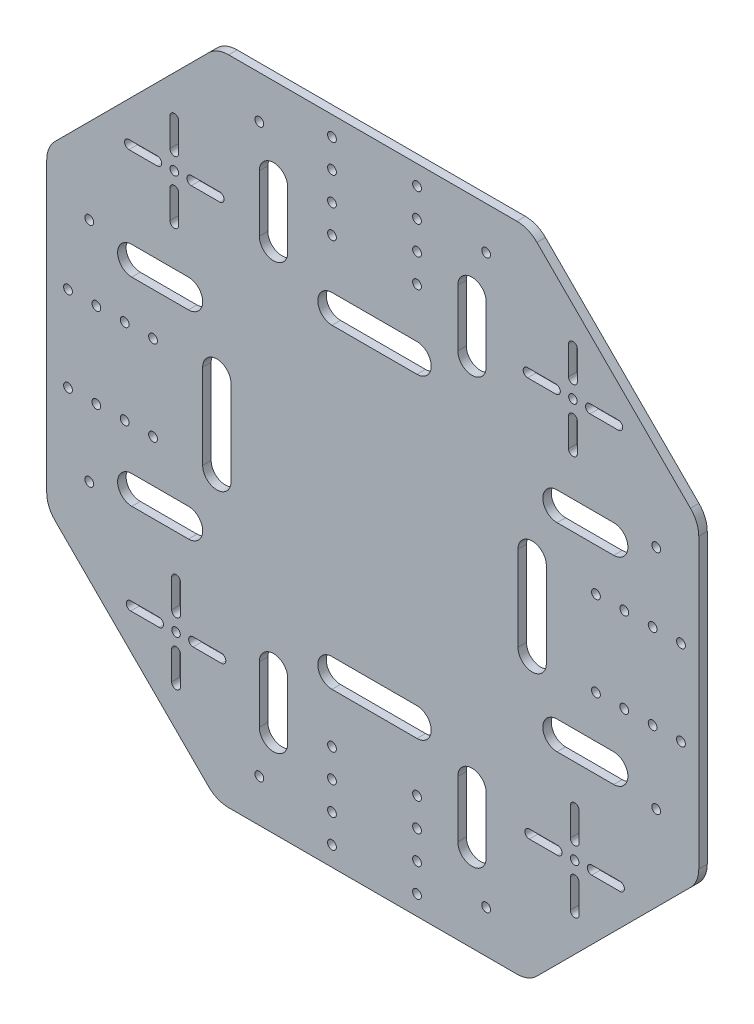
from build123d import *

# Parameters (mm, degrees)
SKETCH_1_R                         = 1.55
EXTRUDE_1_DEPTH                    = 3
SKETCH_3_R                         = 1.55
CUT_EXTRUDE_1_DEPTH                = 714.309192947
CUT_EXTRUDE_2_DEPTH                = 714.309192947
FILLET_1_R                         = 10
SKETCH_5_R                         = 1.5
CUT_EXTRUDE_3_DEPTH                = 714.309192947
PATTERN_CIRCULAR_2_COUNT           = 4
PATTERN_CIRCULAR_1_COUNT           = 4
PATTERN_CIRCULAR_1_COPY_1_SKETCH_R = 1.5
PATTERN_CIRCULAR_1_COPY_1_DEPTH    = 714.309192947
PATTERN_CIRCULAR_1_COPY_2_SKETCH_R = 1.5
PATTERN_CIRCULAR_1_COPY_2_DEPTH    = 714.309192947
PATTERN_CIRCULAR_1_COPY_3_SKETCH_R = 1.5
PATTERN_CIRCULAR_1_COPY_3_DEPTH    = 714.309192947
PATTERN_CIRCULAR_1_COPY_4_SKETCH_R = 1.5
PATTERN_CIRCULAR_1_COPY_4_DEPTH    = 714.309192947
PATTERN_CIRCULAR_1_COPY_5_SKETCH_R = 1.5
PATTERN_CIRCULAR_1_COPY_5_DEPTH    = 714.309192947
PATTERN_CIRCULAR_1_COPY_6_SKETCH_R = 1.5
PATTERN_CIRCULAR_1_COPY_6_DEPTH    = 714.309192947
PATTERN_CIRCULAR_1_COPY_7_SKETCH_R = 1.5
PATTERN_CIRCULAR_1_COPY_7_DEPTH    = 714.309192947
PATTERN_CIRCULAR_1_COPY_8_SKETCH_R = 1.5
PATTERN_CIRCULAR_1_COPY_8_DEPTH    = 714.309192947
PATTERN_CIRCULAR_1_COPY_9_SKETCH_R = 1.5
PATTERN_CIRCULAR_1_COPY_9_DEPTH    = 714.309192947


with BuildPart() as part:
    # Sketch 1 → Extrude 1 (new body)
    with BuildSketch(Plane.XY):
        Polygon((463.239919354, 107.986365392), (523.239919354, 167.986365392), (633.239919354, 167.986365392), (693.239919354, 107.986365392), (693.239919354, -2.013634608), (633.239919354, -62.013634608), (523.239919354, -62.013634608), (463.239919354, -2.013634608), align=None)
        with Locations((538.239919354, 152.986365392)):
            Circle(SKETCH_1_R, mode=Mode.SUBTRACT)
        with Locations((618.239919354, 152.986365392)):
            Circle(SKETCH_1_R, mode=Mode.SUBTRACT)
        with Locations((678.239919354, 92.986365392)):
            Circle(SKETCH_1_R, mode=Mode.SUBTRACT)
        with Locations((678.239919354, 12.986365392)):
            Circle(SKETCH_1_R, mode=Mode.SUBTRACT)
        with Locations((618.239919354, -47.013634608)):
            Circle(SKETCH_1_R, mode=Mode.SUBTRACT)
        with Locations((538.239919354, -47.013634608)):
            Circle(SKETCH_1_R, mode=Mode.SUBTRACT)
        with Locations((478.239919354, 12.986365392)):
            Circle(SKETCH_1_R, mode=Mode.SUBTRACT)
        with Locations((478.239919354, 92.986365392)):
            Circle(SKETCH_1_R, mode=Mode.SUBTRACT)
    extrude(amount=EXTRUDE_1_DEPTH)

    # Sketch 3 → Cut-Extrude 1 (cut, through all)
    with BuildSketch(Plane.XY.offset(3)):
        with BuildLine():
            Line((528.239919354, 37.986365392), (528.239919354, 67.986365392))
            ThreePointArc((528.239919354, 67.986365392), (523.239919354, 72.986365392), (518.239919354, 67.986365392))
            Line((518.239919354, 67.986365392), (518.239919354, 37.986365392))
            ThreePointArc((518.239919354, 37.986365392), (523.239919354, 32.986365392), (528.239919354, 37.986365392))
        make_face()
        with Locations((470.739919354, 67.986365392)):
            Circle(SKETCH_3_R)
        with Locations((470.739919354, 37.986365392)):
            Circle(SKETCH_3_R)
        with Locations((480.739919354, 67.986365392)):
            Circle(SKETCH_3_R)
        with Locations((480.739919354, 37.986365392)):
            Circle(SKETCH_3_R)
        with Locations((490.739919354, 67.986365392)):
            Circle(SKETCH_3_R)
        with Locations((490.739919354, 37.986365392)):
            Circle(SKETCH_3_R)
        with Locations((500.739919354, 67.986365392)):
            Circle(SKETCH_3_R)
        with Locations((500.739919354, 37.986365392)):
            Circle(SKETCH_3_R)
    cut_extrude_1 = extrude(amount=-CUT_EXTRUDE_1_DEPTH, mode=Mode.SUBTRACT)

    # Sketch 4 → Cut-Extrude 2 (cut, through all)
    with BuildSketch(Plane.XY.offset(3)):
        with BuildLine():
            Line((643.239919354, 92.986365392), (663.239919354, 92.986365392))
            ThreePointArc((663.239919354, 92.986365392), (668.239919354, 87.986365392), (663.239919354, 82.986365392))
            Line((663.239919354, 82.986365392), (643.239919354, 82.986365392))
            ThreePointArc((643.239919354, 82.986365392), (638.239919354, 87.986365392), (643.239919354, 92.986365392))
        make_face()
        with BuildLine():
            Line((643.239919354, 12.986365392), (663.239919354, 12.986365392))
            ThreePointArc((663.239919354, 12.986365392), (668.239919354, 17.986365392), (663.239919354, 22.986365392))
            Line((663.239919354, 22.986365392), (643.239919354, 22.986365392))
            ThreePointArc((643.239919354, 22.986365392), (638.239919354, 17.986365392), (643.239919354, 12.986365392))
        make_face()
        with BuildLine():
            Line((608.239919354, -12.013634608), (608.239919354, -32.013634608))
            ThreePointArc((608.239919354, -32.013634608), (613.239919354, -37.013634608), (618.239919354, -32.013634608))
            Line((618.239919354, -32.013634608), (618.239919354, -12.013634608))
            ThreePointArc((618.239919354, -12.013634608), (613.239919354, -7.013634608), (608.239919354, -12.013634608))
        make_face()
        with BuildLine():
            Line((548.239919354, -12.013634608), (548.239919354, -32.013634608))
            ThreePointArc((548.239919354, -32.013634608), (543.239919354, -37.013634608), (538.239919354, -32.013634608))
            Line((538.239919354, -32.013634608), (538.239919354, -12.013634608))
            ThreePointArc((538.239919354, -12.013634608), (543.239919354, -7.013634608), (548.239919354, -12.013634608))
        make_face()
        with BuildLine():
            Line((513.239919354, 22.986365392), (493.239919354, 22.986365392))
            ThreePointArc((493.239919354, 22.986365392), (488.239919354, 17.986365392), (493.239919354, 12.986365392))
            Line((493.239919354, 12.986365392), (513.239919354, 12.986365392))
            ThreePointArc((513.239919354, 12.986365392), (518.239919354, 17.986365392), (513.239919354, 22.986365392))
        make_face()
        with BuildLine():
            Line((513.239919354, 82.986365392), (493.239919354, 82.986365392))
            ThreePointArc((493.239919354, 82.986365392), (488.239919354, 87.986365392), (493.239919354, 92.986365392))
            Line((493.239919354, 92.986365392), (513.239919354, 92.986365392))
            ThreePointArc((513.239919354, 92.986365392), (518.239919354, 87.986365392), (513.239919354, 82.986365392))
        make_face()
        with BuildLine():
            Line((548.239919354, 117.986365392), (548.239919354, 137.986365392))
            ThreePointArc((548.239919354, 137.986365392), (543.239919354, 142.986365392), (538.239919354, 137.986365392))
            Line((538.239919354, 137.986365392), (538.239919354, 117.986365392))
            ThreePointArc((538.239919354, 117.986365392), (543.239919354, 112.986365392), (548.239919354, 117.986365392))
        make_face()
        with BuildLine():
            Line((608.239919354, 117.986365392), (608.239919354, 137.986365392))
            ThreePointArc((608.239919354, 137.986365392), (613.239919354, 142.986365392), (618.239919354, 137.986365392))
            Line((618.239919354, 137.986365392), (618.239919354, 117.986365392))
            ThreePointArc((618.239919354, 117.986365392), (613.239919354, 112.986365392), (608.239919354, 117.986365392))
        make_face()
    extrude(amount=-CUT_EXTRUDE_2_DEPTH, mode=Mode.SUBTRACT)

    # Fillet 1
    fillet_1_edges = [part.edges().sort_by_distance(p)[0] for p in [
        (633.239919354, 167.986365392, 1.5),
        (693.239919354, 107.986365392, 1.5),
        (693.239919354, -2.013634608, 1.5),
        (633.239919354, -62.013634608, 1.5),
        (523.239919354, -62.013634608, 1.5),
        (463.239919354, -2.013634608, 1.5),
        (463.239919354, 107.986365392, 1.5),
        (523.239919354, 167.986365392, 1.5),
    ]]
    fillet(fillet_1_edges, radius=FILLET_1_R)

    # Sketch 5 → Cut-Extrude 3 (cut, through all)
    with BuildSketch(Plane.XY.offset(3)):
        with Locations((508.239919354, 122.986365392)):
            Circle(SKETCH_5_R)
        with BuildLine():
            Line((514.239919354, 124.536365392), (524.239919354, 124.536365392))
            ThreePointArc((524.239919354, 124.536365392), (525.789919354, 122.986365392), (524.239919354, 121.436365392))
            Line((524.239919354, 121.436365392), (514.239919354, 121.436365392))
            ThreePointArc((514.239919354, 121.436365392), (512.689919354, 122.986365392), (514.239919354, 124.536365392))
        make_face()
    cut_extrude_3 = extrude(amount=-CUT_EXTRUDE_3_DEPTH, mode=Mode.SUBTRACT)

    # Pattern Circular 2: Cut-Extrude 3 ×4 about axis
    pattern_circular_2_axis = Axis((508.239919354, 122.986365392, 0), (0, 0, 1))
    for i in range(1, PATTERN_CIRCULAR_2_COUNT):
        add(cut_extrude_3.rotate(pattern_circular_2_axis, i * 360 / PATTERN_CIRCULAR_2_COUNT), mode=Mode.SUBTRACT)

    # Pattern Circular 1: Cut-Extrude 1, Cut-Extrude 3 ×4 about axis
    pattern_circular_1_axis = Axis((578.854629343, 52.986365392, 0), (0, 0, 1))
    add([cut_extrude_1.rotate(pattern_circular_1_axis, i * 360 / PATTERN_CIRCULAR_1_COUNT) for i in range(1, PATTERN_CIRCULAR_1_COUNT)], mode=Mode.SUBTRACT)
    add([cut_extrude_3.rotate(pattern_circular_1_axis, i * 360 / PATTERN_CIRCULAR_1_COUNT) for i in range(1, PATTERN_CIRCULAR_1_COUNT)], mode=Mode.SUBTRACT)

    # Pattern Circular 1 copy 1 sketch → Pattern Circular 1 copy 1 (cut, through all)
    with BuildSketch(Plane(origin=(1017.094548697, 105.358020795, 3), x_dir=(-1, 0, 0), z_dir=(0, 0, 1))):
        with Locations((508.239919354, 122.986365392)):
            Circle(PATTERN_CIRCULAR_1_COPY_1_SKETCH_R)
        with BuildLine():
            Line((514.239919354, 124.536365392), (524.239919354, 124.536365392))
            ThreePointArc((524.239919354, 124.536365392), (525.789919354, 122.986365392), (524.239919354, 121.436365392))
            Line((524.239919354, 121.436365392), (514.239919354, 121.436365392))
            ThreePointArc((514.239919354, 121.436365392), (512.689919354, 122.986365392), (514.239919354, 124.536365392))
        make_face()
    extrude(amount=-PATTERN_CIRCULAR_1_COPY_1_DEPTH, mode=Mode.SUBTRACT)

    # Pattern Circular 1 copy 2 sketch → Pattern Circular 1 copy 2 (cut, through all)
    with BuildSketch(Plane(origin=(526.48297394, 491.226284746, 3), x_dir=(0, -1, 0), z_dir=(0, 0, 1))):
        with Locations((508.239919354, 122.986365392)):
            Circle(PATTERN_CIRCULAR_1_COPY_2_SKETCH_R)
        with BuildLine():
            Line((514.239919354, 124.536365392), (524.239919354, 124.536365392))
            ThreePointArc((524.239919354, 124.536365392), (525.789919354, 122.986365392), (524.239919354, 121.436365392))
            Line((524.239919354, 121.436365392), (514.239919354, 121.436365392))
            ThreePointArc((514.239919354, 121.436365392), (512.689919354, 122.986365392), (514.239919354, 124.536365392))
        make_face()
    extrude(amount=-PATTERN_CIRCULAR_1_COPY_2_DEPTH, mode=Mode.SUBTRACT)

    # Pattern Circular 1 copy 3 sketch → Pattern Circular 1 copy 3 (cut, through all)
    with BuildSketch(Plane(origin=(140.614709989, 0.614709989, 3), x_dir=(1, 0, 0), z_dir=(0, 0, 1))):
        with Locations((508.239919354, 122.986365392)):
            Circle(PATTERN_CIRCULAR_1_COPY_3_SKETCH_R)
        with BuildLine():
            Line((514.239919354, 124.536365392), (524.239919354, 124.536365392))
            ThreePointArc((524.239919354, 124.536365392), (525.789919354, 122.986365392), (524.239919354, 121.436365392))
            Line((524.239919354, 121.436365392), (514.239919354, 121.436365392))
            ThreePointArc((514.239919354, 121.436365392), (512.689919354, 122.986365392), (514.239919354, 124.536365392))
        make_face()
    extrude(amount=-PATTERN_CIRCULAR_1_COPY_3_DEPTH, mode=Mode.SUBTRACT)

    # Pattern Circular 1 copy 4 sketch → Pattern Circular 1 copy 4 (cut, through all)
    with BuildSketch(Plane(origin=(385.868263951, 490.611574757, 3), x_dir=(0, -1, 0), z_dir=(0, 0, 1))):
        with Locations((508.239919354, 122.986365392)):
            Circle(PATTERN_CIRCULAR_1_COPY_4_SKETCH_R)
        with BuildLine():
            Line((514.239919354, 124.536365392), (524.239919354, 124.536365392))
            ThreePointArc((524.239919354, 124.536365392), (525.789919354, 122.986365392), (524.239919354, 121.436365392))
            Line((524.239919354, 121.436365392), (514.239919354, 121.436365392))
            ThreePointArc((514.239919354, 121.436365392), (512.689919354, 122.986365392), (514.239919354, 124.536365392))
        make_face()
    extrude(amount=-PATTERN_CIRCULAR_1_COPY_4_DEPTH, mode=Mode.SUBTRACT)

    # Pattern Circular 1 copy 5 sketch → Pattern Circular 1 copy 5 (cut, through all)
    with BuildSketch(Plane(origin=(141.229419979, -140, 3), x_dir=(1, 0, 0), z_dir=(0, 0, 1))):
        with Locations((508.239919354, 122.986365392)):
            Circle(PATTERN_CIRCULAR_1_COPY_5_SKETCH_R)
        with BuildLine():
            Line((514.239919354, 124.536365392), (524.239919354, 124.536365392))
            ThreePointArc((524.239919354, 124.536365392), (525.789919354, 122.986365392), (524.239919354, 121.436365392))
            Line((524.239919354, 121.436365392), (514.239919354, 121.436365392))
            ThreePointArc((514.239919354, 121.436365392), (512.689919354, 122.986365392), (514.239919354, 124.536365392))
        make_face()
    extrude(amount=-PATTERN_CIRCULAR_1_COPY_5_DEPTH, mode=Mode.SUBTRACT)

    # Pattern Circular 1 copy 6 sketch → Pattern Circular 1 copy 6 (cut, through all)
    with BuildSketch(Plane(origin=(771.840994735, -384.638843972, 3), x_dir=(0, 1, 0), z_dir=(0, 0, 1))):
        with Locations((508.239919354, 122.986365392)):
            Circle(PATTERN_CIRCULAR_1_COPY_6_SKETCH_R)
        with BuildLine():
            Line((514.239919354, 124.536365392), (524.239919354, 124.536365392))
            ThreePointArc((524.239919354, 124.536365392), (525.789919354, 122.986365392), (524.239919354, 121.436365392))
            Line((524.239919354, 121.436365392), (514.239919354, 121.436365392))
            ThreePointArc((514.239919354, 121.436365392), (512.689919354, 122.986365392), (514.239919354, 124.536365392))
        make_face()
    extrude(amount=-PATTERN_CIRCULAR_1_COPY_6_DEPTH, mode=Mode.SUBTRACT)

    # Pattern Circular 1 copy 7 sketch → Pattern Circular 1 copy 7 (cut, through all)
    with BuildSketch(Plane(origin=(0.614709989, -140.614709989, 3), x_dir=(1, 0, 0), z_dir=(0, 0, 1))):
        with Locations((508.239919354, 122.986365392)):
            Circle(PATTERN_CIRCULAR_1_COPY_7_SKETCH_R)
        with BuildLine():
            Line((514.239919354, 124.536365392), (524.239919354, 124.536365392))
            ThreePointArc((524.239919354, 124.536365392), (525.789919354, 122.986365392), (524.239919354, 121.436365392))
            Line((524.239919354, 121.436365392), (514.239919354, 121.436365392))
            ThreePointArc((514.239919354, 121.436365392), (512.689919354, 122.986365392), (514.239919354, 124.536365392))
        make_face()
    extrude(amount=-PATTERN_CIRCULAR_1_COPY_7_DEPTH, mode=Mode.SUBTRACT)

    # Pattern Circular 1 copy 8 sketch → Pattern Circular 1 copy 8 (cut, through all)
    with BuildSketch(Plane(origin=(772.455704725, -525.253553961, 3), x_dir=(0, 1, 0), z_dir=(0, 0, 1))):
        with Locations((508.239919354, 122.986365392)):
            Circle(PATTERN_CIRCULAR_1_COPY_8_SKETCH_R)
        with BuildLine():
            Line((514.239919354, 124.536365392), (524.239919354, 124.536365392))
            ThreePointArc((524.239919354, 124.536365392), (525.789919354, 122.986365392), (524.239919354, 121.436365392))
            Line((524.239919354, 121.436365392), (514.239919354, 121.436365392))
            ThreePointArc((514.239919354, 121.436365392), (512.689919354, 122.986365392), (514.239919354, 124.536365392))
        make_face()
    extrude(amount=-PATTERN_CIRCULAR_1_COPY_8_DEPTH, mode=Mode.SUBTRACT)

    # Pattern Circular 1 copy 9 sketch → Pattern Circular 1 copy 9 (cut, through all)
    with BuildSketch(Plane(origin=(1157.094548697, 246.587440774, 3), x_dir=(-1, 0, 0), z_dir=(0, 0, 1))):
        with Locations((508.239919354, 122.986365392)):
            Circle(PATTERN_CIRCULAR_1_COPY_9_SKETCH_R)
        with BuildLine():
            Line((514.239919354, 124.536365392), (524.239919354, 124.536365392))
            ThreePointArc((524.239919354, 124.536365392), (525.789919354, 122.986365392), (524.239919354, 121.436365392))
            Line((524.239919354, 121.436365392), (514.239919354, 121.436365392))
            ThreePointArc((514.239919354, 121.436365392), (512.689919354, 122.986365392), (514.239919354, 124.536365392))
        make_face()
    extrude(amount=-PATTERN_CIRCULAR_1_COPY_9_DEPTH, mode=Mode.SUBTRACT)


solid = part.part
